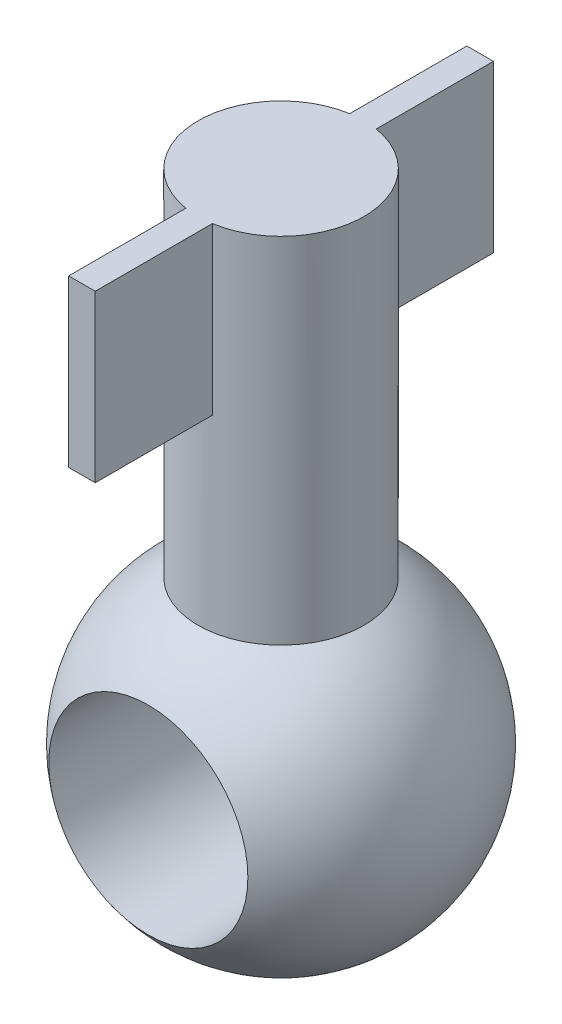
ISO-10303-21;
HEADER;
FILE_DESCRIPTION(('STEP AP214'),'2;1');
FILE_NAME('part.step','',(''),(''),'','','');
FILE_SCHEMA(('AUTOMOTIVE_DESIGN { 1 0 10303 214 1 1 1 1 }'));
ENDSEC;
DATA;
#1=APPLICATION_CONTEXT('core data for automotive mechanical design processes');
#2=APPLICATION_PROTOCOL_DEFINITION('international standard','automotive_design',2000,#1);
#3=PRODUCT_CONTEXT('',#1,'mechanical');
#4=PRODUCT('Part','Part','',(#3));
#5=PRODUCT_RELATED_PRODUCT_CATEGORY('part','',(#4));
#6=PRODUCT_DEFINITION_FORMATION('','',#4);
#7=PRODUCT_DEFINITION_CONTEXT('part definition',#1,'design');
#8=PRODUCT_DEFINITION('design','',#6,#7);
#9=PRODUCT_DEFINITION_SHAPE('','',#8);
#10=(LENGTH_UNIT() NAMED_UNIT(*) SI_UNIT(.MILLI.,.METRE.));
#11=(NAMED_UNIT(*) PLANE_ANGLE_UNIT() SI_UNIT($,.RADIAN.));
#12=(NAMED_UNIT(*) SI_UNIT($,.STERADIAN.) SOLID_ANGLE_UNIT());
#13=UNCERTAINTY_MEASURE_WITH_UNIT(LENGTH_MEASURE(1.E-05),#10,'distance_accuracy_value','');
#14=(GEOMETRIC_REPRESENTATION_CONTEXT(3) GLOBAL_UNCERTAINTY_ASSIGNED_CONTEXT((#13)) GLOBAL_UNIT_ASSIGNED_CONTEXT((#10,
#11,#12)) REPRESENTATION_CONTEXT('',''));
#15=CARTESIAN_POINT('',(0.,0.,0.));
#16=DIRECTION('',(0.,0.,1.));
#17=DIRECTION('',(1.,0.,0.));
#18=AXIS2_PLACEMENT_3D('',#15,#16,#17);
#19=CARTESIAN_POINT('',(0.,0.,0.));
#20=DIRECTION('',(0.,1.,0.));
#21=DIRECTION('',(-1.,0.,0.));
#22=AXIS2_PLACEMENT_3D('',#19,#20,#21);
#23=SPHERICAL_SURFACE('',#22,25.);
#24=CARTESIAN_POINT('',(0.,0.,20.));
#25=DIRECTION('',(0.,0.,-1.));
#26=DIRECTION('',(-1.,0.,0.));
#27=AXIS2_PLACEMENT_3D('',#24,#25,#26);
#28=CIRCLE('',#27,15.);
#29=CARTESIAN_POINT('',(-15.,0.,20.));
#30=VERTEX_POINT('',#29);
#31=EDGE_CURVE('E161',#30,#30,#28,.F.);
#32=ORIENTED_EDGE('',*,*,#31,.F.);
#33=EDGE_LOOP('',(#32));
#34=FACE_BOUND('',#33,.T.);
#35=CARTESIAN_POINT('',(0.,0.,-20.));
#36=DIRECTION('',(0.,0.,1.));
#37=DIRECTION('',(1.,0.,0.));
#38=AXIS2_PLACEMENT_3D('',#35,#36,#37);
#39=CIRCLE('',#38,15.);
#40=CARTESIAN_POINT('',(15.,0.,-20.));
#41=VERTEX_POINT('',#40);
#42=EDGE_CURVE('E152',#41,#41,#39,.F.);
#43=ORIENTED_EDGE('',*,*,#42,.F.);
#44=EDGE_LOOP('',(#43));
#45=FACE_BOUND('',#44,.T.);
#46=CARTESIAN_POINT('',(0.,21.650635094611,0.));
#47=DIRECTION('',(0.,-1.,0.));
#48=DIRECTION('',(0.,0.,-1.));
#49=AXIS2_PLACEMENT_3D('',#46,#47,#48);
#50=CIRCLE('',#49,12.5);
#51=CARTESIAN_POINT('',(0.,21.650635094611,-12.5));
#52=VERTEX_POINT('',#51);
#53=EDGE_CURVE('E156',#52,#52,#50,.F.);
#54=ORIENTED_EDGE('',*,*,#53,.F.);
#55=EDGE_LOOP('',(#54));
#56=FACE_BOUND('',#55,.T.);
#57=ADVANCED_FACE('F31',(#34,#45,#56),#23,.T.);
#58=CARTESIAN_POINT('',(0.,-500000.,0.));
#59=DIRECTION('',(0.,1.,0.));
#60=DIRECTION('',(0.,0.,1.));
#61=AXIS2_PLACEMENT_3D('',#58,#59,#60);
#62=CYLINDRICAL_SURFACE('',#61,12.5);
#63=DIRECTION('',(0.,1.,0.));
#64=VECTOR('',#63,1.);
#65=CARTESIAN_POINT('',(-1.99999999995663,-500000.,12.3389626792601));
#66=LINE('',#65,#64);
#67=CARTESIAN_POINT('',(-2.,75.,12.3389626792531));
#68=VERTEX_POINT('',#67);
#69=CARTESIAN_POINT('',(-2.,50.0000000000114,12.3389626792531));
#70=VERTEX_POINT('',#69);
#71=EDGE_CURVE('E97',#68,#70,#66,.F.);
#72=ORIENTED_EDGE('',*,*,#71,.F.);
#73=CARTESIAN_POINT('',(0.,75.,0.));
#74=DIRECTION('',(0.,1.,0.));
#75=DIRECTION('',(0.,0.,1.));
#76=AXIS2_PLACEMENT_3D('',#73,#74,#75);
#77=CIRCLE('',#76,12.5);
#78=CARTESIAN_POINT('',(-2.,75.,-12.3389626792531));
#79=VERTEX_POINT('',#78);
#80=EDGE_CURVE('E157',#79,#68,#77,.T.);
#81=ORIENTED_EDGE('',*,*,#80,.F.);
#82=DIRECTION('',(0.,1.,0.));
#83=VECTOR('',#82,1.);
#84=CARTESIAN_POINT('',(-1.99999999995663,-500000.,-12.3389626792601));
#85=LINE('',#84,#83);
#86=CARTESIAN_POINT('',(-2.,50.0000000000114,-12.3389626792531));
#87=VERTEX_POINT('',#86);
#88=EDGE_CURVE('E148',#87,#79,#85,.T.);
#89=ORIENTED_EDGE('',*,*,#88,.F.);
#90=CARTESIAN_POINT('',(0.,50.0000000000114,0.));
#91=DIRECTION('',(0.,-1.,0.));
#92=DIRECTION('',(0.,0.,-1.));
#93=AXIS2_PLACEMENT_3D('',#90,#91,#92);
#94=CIRCLE('',#93,12.5);
#95=CARTESIAN_POINT('',(2.,50.0000000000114,-12.3389626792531));
#96=VERTEX_POINT('',#95);
#97=EDGE_CURVE('E34',#96,#87,#94,.F.);
#98=ORIENTED_EDGE('',*,*,#97,.F.);
#99=DIRECTION('',(0.,1.,0.));
#100=VECTOR('',#99,1.);
#101=CARTESIAN_POINT('',(2.0000000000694,-500000.,-12.3389626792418));
#102=LINE('',#101,#100);
#103=CARTESIAN_POINT('',(2.,75.,-12.3389626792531));
#104=VERTEX_POINT('',#103);
#105=EDGE_CURVE('E146',#104,#96,#102,.F.);
#106=ORIENTED_EDGE('',*,*,#105,.F.);
#107=CARTESIAN_POINT('',(2.,75.,12.3389626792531));
#108=VERTEX_POINT('',#107);
#109=EDGE_CURVE('E153',#108,#104,#77,.T.);
#110=ORIENTED_EDGE('',*,*,#109,.F.);
#111=DIRECTION('',(0.,1.,0.));
#112=VECTOR('',#111,1.);
#113=CARTESIAN_POINT('',(2.0000000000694,-500000.,12.3389626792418));
#114=LINE('',#113,#112);
#115=CARTESIAN_POINT('',(2.,50.0000000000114,12.3389626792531));
#116=VERTEX_POINT('',#115);
#117=EDGE_CURVE('E134',#116,#108,#114,.T.);
#118=ORIENTED_EDGE('',*,*,#117,.F.);
#119=EDGE_CURVE('E11',#70,#116,#94,.F.);
#120=ORIENTED_EDGE('',*,*,#119,.F.);
#121=EDGE_LOOP('',(#72,#81,#89,#98,#106,#110,#118,#120));
#122=FACE_BOUND('',#121,.T.);
#123=ORIENTED_EDGE('',*,*,#53,.T.);
#124=EDGE_LOOP('',(#123));
#125=FACE_BOUND('',#124,.T.);
#126=ADVANCED_FACE('F168',(#122,#125),#62,.T.);
#127=CARTESIAN_POINT('',(0.,75.,0.));
#128=DIRECTION('',(0.,1.,0.));
#129=DIRECTION('',(0.,0.,1.));
#130=AXIS2_PLACEMENT_3D('',#127,#128,#129);
#131=PLANE('',#130);
#132=ORIENTED_EDGE('',*,*,#109,.T.);
#133=DIRECTION('',(0.,0.,1.));
#134=VECTOR('',#133,1.);
#135=CARTESIAN_POINT('',(2.,75.,-30.));
#136=LINE('',#135,#134);
#137=CARTESIAN_POINT('',(2.,75.,-30.));
#138=VERTEX_POINT('',#137);
#139=EDGE_CURVE('E136',#138,#104,#136,.T.);
#140=ORIENTED_EDGE('',*,*,#139,.F.);
#141=DIRECTION('',(-1.,0.,0.));
#142=VECTOR('',#141,1.);
#143=CARTESIAN_POINT('',(-2.,75.,-30.));
#144=LINE('',#143,#142);
#145=CARTESIAN_POINT('',(-2.,75.,-30.));
#146=VERTEX_POINT('',#145);
#147=EDGE_CURVE('E100',#138,#146,#144,.T.);
#148=ORIENTED_EDGE('',*,*,#147,.T.);
#149=DIRECTION('',(0.,0.,1.));
#150=VECTOR('',#149,1.);
#151=CARTESIAN_POINT('',(-2.,75.,-30.));
#152=LINE('',#151,#150);
#153=EDGE_CURVE('E131',#146,#79,#152,.T.);
#154=ORIENTED_EDGE('',*,*,#153,.T.);
#155=ORIENTED_EDGE('',*,*,#80,.T.);
#156=CARTESIAN_POINT('',(-2.,75.,30.));
#157=VERTEX_POINT('',#156);
#158=EDGE_CURVE('E135',#68,#157,#152,.T.);
#159=ORIENTED_EDGE('',*,*,#158,.T.);
#160=DIRECTION('',(-1.,0.,0.));
#161=VECTOR('',#160,1.);
#162=CARTESIAN_POINT('',(-2.,75.,30.));
#163=LINE('',#162,#161);
#164=CARTESIAN_POINT('',(2.,75.,30.));
#165=VERTEX_POINT('',#164);
#166=EDGE_CURVE('E115',#165,#157,#163,.T.);
#167=ORIENTED_EDGE('',*,*,#166,.F.);
#168=EDGE_CURVE('E139',#108,#165,#136,.T.);
#169=ORIENTED_EDGE('',*,*,#168,.F.);
#170=EDGE_LOOP('',(#132,#140,#148,#154,#155,#159,#167,#169));
#171=FACE_BOUND('',#170,.T.);
#172=ADVANCED_FACE('F167',(#171),#131,.T.);
#173=CARTESIAN_POINT('',(0.,0.,-25.));
#174=DIRECTION('',(0.,0.,1.));
#175=DIRECTION('',(1.,0.,0.));
#176=AXIS2_PLACEMENT_3D('',#173,#174,#175);
#177=CYLINDRICAL_SURFACE('',#176,15.);
#178=ORIENTED_EDGE('',*,*,#31,.T.);
#179=EDGE_LOOP('',(#178));
#180=FACE_BOUND('',#179,.T.);
#181=ORIENTED_EDGE('',*,*,#42,.T.);
#182=EDGE_LOOP('',(#181));
#183=FACE_BOUND('',#182,.T.);
#184=ADVANCED_FACE('F206',(#180,#183),#177,.F.);
#185=CARTESIAN_POINT('',(-2.,50.,-30.));
#186=DIRECTION('',(0.,0.,1.));
#187=DIRECTION('',(1.,0.,0.));
#188=AXIS2_PLACEMENT_3D('',#185,#186,#187);
#189=PLANE('',#188);
#190=DIRECTION('',(0.,-1.,0.));
#191=VECTOR('',#190,1.);
#192=CARTESIAN_POINT('',(-2.,75.,-30.));
#193=LINE('',#192,#191);
#194=CARTESIAN_POINT('',(-2.,50.,-30.));
#195=VERTEX_POINT('',#194);
#196=EDGE_CURVE('E120',#146,#195,#193,.T.);
#197=ORIENTED_EDGE('',*,*,#196,.F.);
#198=ORIENTED_EDGE('',*,*,#147,.F.);
#199=DIRECTION('',(0.,1.,0.));
#200=VECTOR('',#199,1.);
#201=CARTESIAN_POINT('',(2.,75.,-30.));
#202=LINE('',#201,#200);
#203=CARTESIAN_POINT('',(2.,50.,-30.));
#204=VERTEX_POINT('',#203);
#205=EDGE_CURVE('E126',#204,#138,#202,.T.);
#206=ORIENTED_EDGE('',*,*,#205,.F.);
#207=DIRECTION('',(1.,0.,0.));
#208=VECTOR('',#207,1.);
#209=CARTESIAN_POINT('',(-2.,50.,-30.));
#210=LINE('',#209,#208);
#211=EDGE_CURVE('E123',#195,#204,#210,.T.);
#212=ORIENTED_EDGE('',*,*,#211,.F.);
#213=EDGE_LOOP('',(#197,#198,#206,#212));
#214=FACE_BOUND('',#213,.T.);
#215=ADVANCED_FACE('F178',(#214),#189,.F.);
#216=CARTESIAN_POINT('',(-2.,50.,-30.));
#217=DIRECTION('',(0.,-1.,0.));
#218=DIRECTION('',(0.,0.,-1.));
#219=AXIS2_PLACEMENT_3D('',#216,#217,#218);
#220=PLANE('',#219);
#221=DIRECTION('',(0.,0.,1.));
#222=VECTOR('',#221,1.);
#223=CARTESIAN_POINT('',(2.,50.,-30.));
#224=LINE('',#223,#222);
#225=EDGE_CURVE('E140',#204,#96,#224,.T.);
#226=ORIENTED_EDGE('',*,*,#225,.T.);
#227=ORIENTED_EDGE('',*,*,#97,.T.);
#228=DIRECTION('',(0.,0.,1.));
#229=VECTOR('',#228,1.);
#230=CARTESIAN_POINT('',(-2.,50.,-30.));
#231=LINE('',#230,#229);
#232=EDGE_CURVE('E99',#195,#87,#231,.T.);
#233=ORIENTED_EDGE('',*,*,#232,.F.);
#234=ORIENTED_EDGE('',*,*,#211,.T.);
#235=EDGE_LOOP('',(#226,#227,#233,#234));
#236=FACE_BOUND('',#235,.T.);
#237=ADVANCED_FACE('F175',(#236),#220,.T.);
#238=CARTESIAN_POINT('',(2.,75.,-30.));
#239=DIRECTION('',(1.,0.,0.));
#240=DIRECTION('',(0.,1.,0.));
#241=AXIS2_PLACEMENT_3D('',#238,#239,#240);
#242=PLANE('',#241);
#243=ORIENTED_EDGE('',*,*,#139,.T.);
#244=ORIENTED_EDGE('',*,*,#105,.T.);
#245=ORIENTED_EDGE('',*,*,#225,.F.);
#246=ORIENTED_EDGE('',*,*,#205,.T.);
#247=EDGE_LOOP('',(#243,#244,#245,#246));
#248=FACE_BOUND('',#247,.T.);
#249=ADVANCED_FACE('F181',(#248),#242,.T.);
#250=CARTESIAN_POINT('',(-2.,75.,-30.));
#251=DIRECTION('',(-1.,0.,0.));
#252=DIRECTION('',(0.,-1.,0.));
#253=AXIS2_PLACEMENT_3D('',#250,#251,#252);
#254=PLANE('',#253);
#255=ORIENTED_EDGE('',*,*,#232,.T.);
#256=ORIENTED_EDGE('',*,*,#88,.T.);
#257=ORIENTED_EDGE('',*,*,#153,.F.);
#258=ORIENTED_EDGE('',*,*,#196,.T.);
#259=EDGE_LOOP('',(#255,#256,#257,#258));
#260=FACE_BOUND('',#259,.T.);
#261=ADVANCED_FACE('F171',(#260),#254,.T.);
#262=CARTESIAN_POINT('',(-2.,50.,30.));
#263=VERTEX_POINT('',#262);
#264=EDGE_CURVE('E91',#70,#263,#231,.T.);
#265=ORIENTED_EDGE('',*,*,#264,.F.);
#266=ORIENTED_EDGE('',*,*,#119,.T.);
#267=CARTESIAN_POINT('',(2.,50.,30.));
#268=VERTEX_POINT('',#267);
#269=EDGE_CURVE('E106',#116,#268,#224,.T.);
#270=ORIENTED_EDGE('',*,*,#269,.T.);
#271=DIRECTION('',(1.,0.,0.));
#272=VECTOR('',#271,1.);
#273=CARTESIAN_POINT('',(-2.,50.,30.));
#274=LINE('',#273,#272);
#275=EDGE_CURVE('E103',#263,#268,#274,.T.);
#276=ORIENTED_EDGE('',*,*,#275,.F.);
#277=EDGE_LOOP('',(#265,#266,#270,#276));
#278=FACE_BOUND('',#277,.T.);
#279=ADVANCED_FACE('F104',(#278),#220,.T.);
#280=ORIENTED_EDGE('',*,*,#158,.F.);
#281=ORIENTED_EDGE('',*,*,#71,.T.);
#282=ORIENTED_EDGE('',*,*,#264,.T.);
#283=DIRECTION('',(0.,-1.,0.));
#284=VECTOR('',#283,1.);
#285=CARTESIAN_POINT('',(-2.,75.,30.));
#286=LINE('',#285,#284);
#287=EDGE_CURVE('E96',#157,#263,#286,.T.);
#288=ORIENTED_EDGE('',*,*,#287,.F.);
#289=EDGE_LOOP('',(#280,#281,#282,#288));
#290=FACE_BOUND('',#289,.T.);
#291=ADVANCED_FACE('F94',(#290),#254,.T.);
#292=ORIENTED_EDGE('',*,*,#269,.F.);
#293=ORIENTED_EDGE('',*,*,#117,.T.);
#294=ORIENTED_EDGE('',*,*,#168,.T.);
#295=DIRECTION('',(0.,1.,0.));
#296=VECTOR('',#295,1.);
#297=CARTESIAN_POINT('',(2.,75.,30.));
#298=LINE('',#297,#296);
#299=EDGE_CURVE('E110',#268,#165,#298,.T.);
#300=ORIENTED_EDGE('',*,*,#299,.F.);
#301=EDGE_LOOP('',(#292,#293,#294,#300));
#302=FACE_BOUND('',#301,.T.);
#303=ADVANCED_FACE('F184',(#302),#242,.T.);
#304=CARTESIAN_POINT('',(-2.,50.,30.));
#305=DIRECTION('',(0.,0.,1.));
#306=DIRECTION('',(1.,0.,0.));
#307=AXIS2_PLACEMENT_3D('',#304,#305,#306);
#308=PLANE('',#307);
#309=ORIENTED_EDGE('',*,*,#287,.T.);
#310=ORIENTED_EDGE('',*,*,#275,.T.);
#311=ORIENTED_EDGE('',*,*,#299,.T.);
#312=ORIENTED_EDGE('',*,*,#166,.T.);
#313=EDGE_LOOP('',(#309,#310,#311,#312));
#314=FACE_BOUND('',#313,.T.);
#315=ADVANCED_FACE('F113',(#314),#308,.T.);
#316=CLOSED_SHELL('',(#57,#126,#172,#184,#215,#237,#249,#261,#279,#291,#303,#315));
#317=MANIFOLD_SOLID_BREP('B2',#316);
#318=ADVANCED_BREP_SHAPE_REPRESENTATION('',(#18,#317),#14);
#319=SHAPE_DEFINITION_REPRESENTATION(#9,#318);
ENDSEC;
END-ISO-10303-21;
